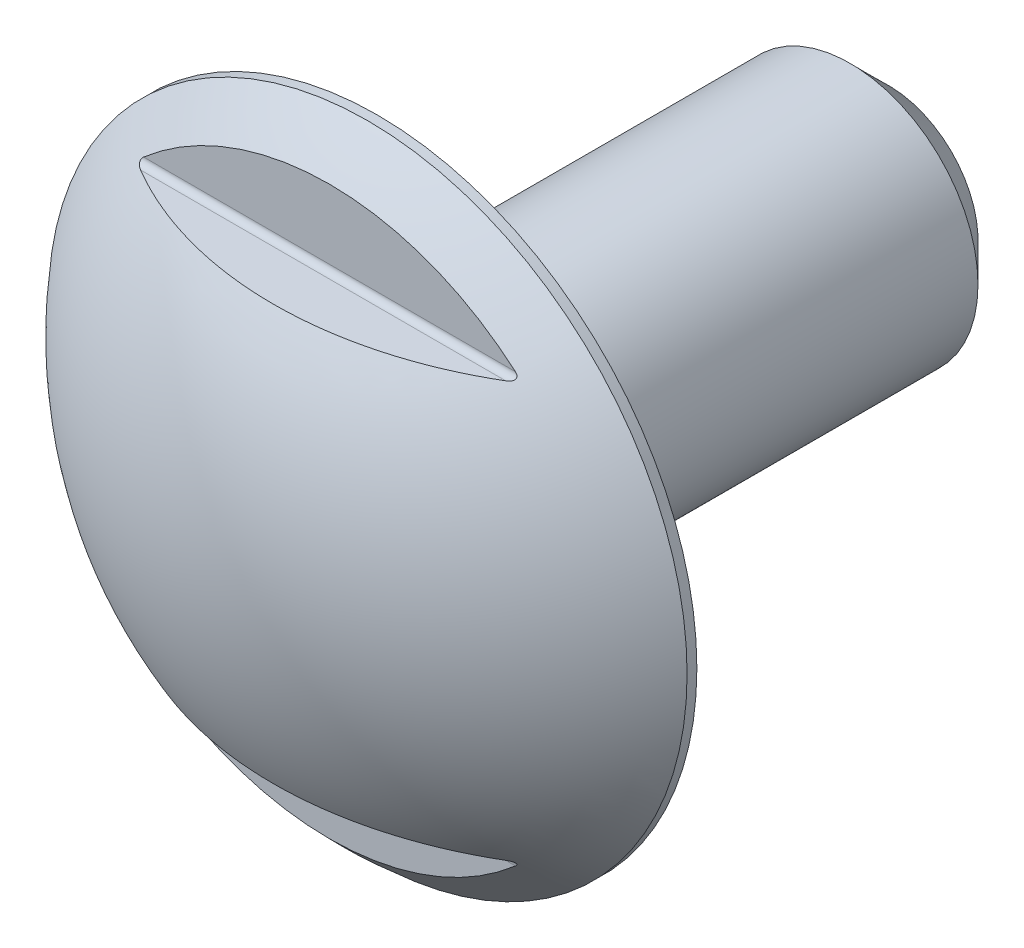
ISO-10303-21;
HEADER;
FILE_DESCRIPTION(('STEP AP214'),'2;1');
FILE_NAME('part.step','',(''),(''),'','','');
FILE_SCHEMA(('AUTOMOTIVE_DESIGN { 1 0 10303 214 1 1 1 1 }'));
ENDSEC;
DATA;
#1=APPLICATION_CONTEXT('core data for automotive mechanical design processes');
#2=APPLICATION_PROTOCOL_DEFINITION('international standard','automotive_design',2000,#1);
#3=PRODUCT_CONTEXT('',#1,'mechanical');
#4=PRODUCT('Part','Part','',(#3));
#5=PRODUCT_RELATED_PRODUCT_CATEGORY('part','',(#4));
#6=PRODUCT_DEFINITION_FORMATION('','',#4);
#7=PRODUCT_DEFINITION_CONTEXT('part definition',#1,'design');
#8=PRODUCT_DEFINITION('design','',#6,#7);
#9=PRODUCT_DEFINITION_SHAPE('','',#8);
#10=(LENGTH_UNIT() NAMED_UNIT(*) SI_UNIT(.MILLI.,.METRE.));
#11=(NAMED_UNIT(*) PLANE_ANGLE_UNIT() SI_UNIT($,.RADIAN.));
#12=(NAMED_UNIT(*) SI_UNIT($,.STERADIAN.) SOLID_ANGLE_UNIT());
#13=UNCERTAINTY_MEASURE_WITH_UNIT(LENGTH_MEASURE(1.E-05),#10,'distance_accuracy_value','');
#14=(GEOMETRIC_REPRESENTATION_CONTEXT(3) GLOBAL_UNCERTAINTY_ASSIGNED_CONTEXT((#13)) GLOBAL_UNIT_ASSIGNED_CONTEXT((#10,
#11,#12)) REPRESENTATION_CONTEXT('',''));
#15=CARTESIAN_POINT('',(0.,0.,0.));
#16=DIRECTION('',(0.,0.,1.));
#17=DIRECTION('',(1.,0.,0.));
#18=AXIS2_PLACEMENT_3D('',#15,#16,#17);
#19=CARTESIAN_POINT('',(0.,0.,-8.));
#20=DIRECTION('',(0.,0.,-1.));
#21=DIRECTION('',(0.,-1.,0.));
#22=AXIS2_PLACEMENT_3D('',#19,#20,#21);
#23=SPHERICAL_SURFACE('',#22,13.);
#24=CARTESIAN_POINT('',(5.71455323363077,-6.50000010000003,1.7002));
#25=CARTESIAN_POINT('',(5.72369421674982,-6.49999891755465,1.69481571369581));
#26=CARTESIAN_POINT('',(5.73277148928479,-6.50020699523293,1.68931126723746));
#27=CARTESIAN_POINT('',(5.75077060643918,-6.50112929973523,1.67801987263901));
#28=CARTESIAN_POINT('',(5.75969170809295,-6.50184549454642,1.67223190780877));
#29=CARTESIAN_POINT('',(5.77737661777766,-6.50388435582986,1.66030660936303));
#30=CARTESIAN_POINT('',(5.78613755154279,-6.50521371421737,1.65416609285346));
#31=CARTESIAN_POINT('',(5.80327525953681,-6.50861084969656,1.64158164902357));
#32=CARTESIAN_POINT('',(5.81165267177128,-6.51067734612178,1.63513826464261));
#33=CARTESIAN_POINT('',(5.82612016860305,-6.51519179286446,1.62333991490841));
#34=CARTESIAN_POINT('',(5.832315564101,-6.51746296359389,1.61804778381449));
#35=CARTESIAN_POINT('',(5.84422792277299,-6.52269970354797,1.60726079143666));
#36=CARTESIAN_POINT('',(5.8499449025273,-6.52566524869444,1.60176593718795));
#37=CARTESIAN_POINT('',(5.8607513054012,-6.53248829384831,1.59052992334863));
#38=CARTESIAN_POINT('',(5.86583153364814,-6.53635696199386,1.58478648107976));
#39=CARTESIAN_POINT('',(5.87489997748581,-6.54513797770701,1.57323308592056));
#40=CARTESIAN_POINT('',(5.87889217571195,-6.55004639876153,1.56742345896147));
#41=CARTESIAN_POINT('',(5.8840939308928,-6.55895625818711,1.55811489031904));
#42=CARTESIAN_POINT('',(5.8857861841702,-6.56261599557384,1.55456022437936));
#43=CARTESIAN_POINT('',(5.88840952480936,-6.57035151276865,1.54762498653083));
#44=CARTESIAN_POINT('',(5.88934135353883,-6.57442688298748,1.54424424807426));
#45=CARTESIAN_POINT('',(5.89035474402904,-6.58292472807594,1.53775927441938));
#46=CARTESIAN_POINT('',(5.89043231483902,-6.58734873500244,1.5346564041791));
#47=CARTESIAN_POINT('',(5.88971811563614,-6.59638433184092,1.52884899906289));
#48=CARTESIAN_POINT('',(5.88892602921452,-6.60099598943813,1.526144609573));
#49=CARTESIAN_POINT('',(5.88661801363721,-6.61000707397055,1.52132138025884));
#50=CARTESIAN_POINT('',(5.8851428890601,-6.61440472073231,1.51917902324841));
#51=CARTESIAN_POINT('',(5.88159909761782,-6.62313388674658,1.51529902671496));
#52=CARTESIAN_POINT('',(5.87953032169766,-6.62746539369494,1.51356146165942));
#53=CARTESIAN_POINT('',(5.87338299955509,-6.6388360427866,1.5094321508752));
#54=CARTESIAN_POINT('',(5.8688815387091,-6.64576555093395,1.50737089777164));
#55=CARTESIAN_POINT('',(5.85897930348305,-6.65918909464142,1.50408517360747));
#56=CARTESIAN_POINT('',(5.85357406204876,-6.66568073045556,1.50286502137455));
#57=CARTESIAN_POINT('',(5.84330256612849,-6.67695936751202,1.50126703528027));
#58=CARTESIAN_POINT('',(5.83854245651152,-6.6818288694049,1.50077004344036));
#59=CARTESIAN_POINT('',(5.82878697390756,-6.69123844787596,1.50013768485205));
#60=CARTESIAN_POINT('',(5.8237948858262,-6.69578163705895,1.49999827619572));
#61=CARTESIAN_POINT('',(5.81870415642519,-6.7002,1.50000010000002));
#62=B_SPLINE_CURVE_WITH_KNOTS('',3,(#24,#25,#26,#27,#28,#29,#30,#31,#32,#33,#34,#35,#36,#37,#38,
#39,#40,#41,#42,#43,#44,#45,#46,#47,#48,#49,#50,#51,#52,#53,#54,#55,#56,#57,#58,#59,#60,#61),
.UNSPECIFIED.,.F.,.F.,(4,2,2,2,2,2,2,2,2,2,2,2,2,2,2,2,2,2,4),(0.,0.0318328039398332,
0.0637895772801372,0.0961036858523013,0.128361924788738,0.153703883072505,0.179044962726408,
0.204717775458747,0.230295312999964,0.246359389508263,0.262407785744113,0.27853112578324,
0.2946603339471,0.309930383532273,0.325203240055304,0.350606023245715,0.376138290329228,
0.396599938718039,0.416829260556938),.UNSPECIFIED.);
#63=CARTESIAN_POINT('',(5.71489282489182,-6.5,1.7));
#64=VERTEX_POINT('',#63);
#65=CARTESIAN_POINT('',(5.81893461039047,-6.7,1.5));
#66=VERTEX_POINT('',#65);
#67=EDGE_CURVE('E65',#64,#66,#62,.T.);
#68=ORIENTED_EDGE('',*,*,#67,.T.);
#69=CARTESIAN_POINT('',(0.,0.,1.5));
#70=DIRECTION('',(0.,0.,1.));
#71=DIRECTION('',(-1.,0.,0.));
#72=AXIS2_PLACEMENT_3D('',#69,#70,#71);
#73=CIRCLE('',#72,8.87411967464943);
#74=CARTESIAN_POINT('',(-5.81893461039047,-6.7,1.5));
#75=VERTEX_POINT('',#74);
#76=EDGE_CURVE('E53',#66,#75,#73,.F.);
#77=ORIENTED_EDGE('',*,*,#76,.T.);
#78=CARTESIAN_POINT('',(-5.81870415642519,-6.7002,1.50000010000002));
#79=CARTESIAN_POINT('',(-5.82629700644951,-6.69359546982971,1.5000078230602));
#80=CARTESIAN_POINT('',(-5.8337158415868,-6.68669303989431,1.50031572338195));
#81=CARTESIAN_POINT('',(-5.84793411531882,-6.67213648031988,1.50180858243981));
#82=CARTESIAN_POINT('',(-5.85472041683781,-6.66447129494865,1.50300882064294));
#83=CARTESIAN_POINT('',(-5.86512205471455,-6.651028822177,1.50600903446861));
#84=CARTESIAN_POINT('',(-5.86905647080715,-6.64543415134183,1.5074933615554));
#85=CARTESIAN_POINT('',(-5.87613562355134,-6.63398909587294,1.51111281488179));
#86=CARTESIAN_POINT('',(-5.87928438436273,-6.62814020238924,1.51324449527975));
#87=CARTESIAN_POINT('',(-5.88396010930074,-6.61758139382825,1.51770242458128));
#88=CARTESIAN_POINT('',(-5.88569115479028,-6.61290212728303,1.51988416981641));
#89=CARTESIAN_POINT('',(-5.88837457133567,-6.60355515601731,1.5247117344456));
#90=CARTESIAN_POINT('',(-5.88932730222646,-6.59888744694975,1.52735733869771));
#91=CARTESIAN_POINT('',(-5.89035948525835,-6.58969138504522,1.53308251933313));
#92=CARTESIAN_POINT('',(-5.89043489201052,-6.58516377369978,1.53616403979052));
#93=CARTESIAN_POINT('',(-5.88969308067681,-6.57642454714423,1.54265085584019));
#94=CARTESIAN_POINT('',(-5.88887554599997,-6.57221304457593,1.54605626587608));
#95=CARTESIAN_POINT('',(-5.88651478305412,-6.56447623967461,1.55283316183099));
#96=CARTESIAN_POINT('',(-5.88502241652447,-6.56092408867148,1.55619234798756));
#97=CARTESIAN_POINT('',(-5.88144643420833,-6.55422204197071,1.56299049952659));
#98=CARTESIAN_POINT('',(-5.87936265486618,-6.55107225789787,1.56642948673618));
#99=CARTESIAN_POINT('',(-5.87315851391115,-6.54318228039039,1.57563821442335));
#100=CARTESIAN_POINT('',(-5.86861046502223,-6.5387953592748,1.58142154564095));
#101=CARTESIAN_POINT('',(-5.8586215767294,-6.53097427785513,1.59286202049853));
#102=CARTESIAN_POINT('',(-5.85317780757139,-6.52754334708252,1.59851867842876));
#103=CARTESIAN_POINT('',(-5.83713343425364,-6.51904567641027,1.61406010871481));
#104=CARTESIAN_POINT('',(-5.82587402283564,-6.51484720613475,1.62373070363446));
#105=CARTESIAN_POINT('',(-5.80233765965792,-6.50821128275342,1.64242201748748));
#106=CARTESIAN_POINT('',(-5.79005692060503,-6.50578074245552,1.65144006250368));
#107=CARTESIAN_POINT('',(-5.76725069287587,-6.50256854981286,1.66724254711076));
#108=CARTESIAN_POINT('',(-5.75682527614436,-6.50156384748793,1.67412977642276));
#109=CARTESIAN_POINT('',(-5.73580990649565,-6.50028426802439,1.68746318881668));
#110=CARTESIAN_POINT('',(-5.72522298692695,-6.50000155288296,1.69391336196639));
#111=CARTESIAN_POINT('',(-5.71455323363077,-6.50000010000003,1.7002));
#112=B_SPLINE_CURVE_WITH_KNOTS('',3,(#78,#79,#80,#81,#82,#83,#84,#85,#86,#87,#88,#89,#90,#91,
#92,#93,#94,#95,#96,#97,#98,#99,#100,#101,#102,#103,#104,#105,#106,#107,#108,#109,#110,#111),
.UNSPECIFIED.,.F.,.F.,(4,2,2,2,2,2,2,2,2,2,2,2,2,2,2,2,4),(0.,0.0302839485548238,
0.0610987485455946,0.0820341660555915,0.102860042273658,0.119131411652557,0.135395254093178,
0.15173406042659,0.168078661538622,0.183356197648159,0.198637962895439,0.224186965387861,
0.249821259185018,0.295836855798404,0.342031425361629,0.379606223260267,0.41677133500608),.UNSPECIFIED.);
#113=CARTESIAN_POINT('',(-5.71489282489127,-6.5,1.7));
#114=VERTEX_POINT('',#113);
#115=EDGE_CURVE('E58',#75,#114,#112,.T.);
#116=ORIENTED_EDGE('',*,*,#115,.T.);
#117=CARTESIAN_POINT('',(0.,-6.5,-8.));
#118=DIRECTION('',(0.,-1.,0.));
#119=DIRECTION('',(0.,0.,1.));
#120=AXIS2_PLACEMENT_3D('',#117,#118,#119);
#121=CIRCLE('',#120,11.2583302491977);
#122=EDGE_CURVE('E70',#114,#64,#121,.F.);
#123=ORIENTED_EDGE('',*,*,#122,.T.);
#124=EDGE_LOOP('',(#68,#77,#116,#123));
#125=FACE_BOUND('',#124,.T.);
#126=CARTESIAN_POINT('',(0.,0.,0.306623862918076));
#127=DIRECTION('',(0.,0.,-1.));
#128=DIRECTION('',(1.,0.,0.));
#129=AXIS2_PLACEMENT_3D('',#126,#127,#128);
#130=CIRCLE('',#129,10.);
#131=CARTESIAN_POINT('',(10.,0.,0.306623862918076));
#132=VERTEX_POINT('',#131);
#133=EDGE_CURVE('E59',#132,#132,#130,.T.);
#134=ORIENTED_EDGE('',*,*,#133,.F.);
#135=EDGE_LOOP('',(#134));
#136=FACE_BOUND('',#135,.T.);
#137=CARTESIAN_POINT('',(-5.71455323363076,6.50000010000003,1.7002));
#138=CARTESIAN_POINT('',(-5.72369421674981,6.49999891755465,1.69481571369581));
#139=CARTESIAN_POINT('',(-5.73277148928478,6.50020699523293,1.68931126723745));
#140=CARTESIAN_POINT('',(-5.75077060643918,6.50112929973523,1.67801987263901));
#141=CARTESIAN_POINT('',(-5.75969170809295,6.50184549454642,1.67223190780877));
#142=CARTESIAN_POINT('',(-5.77737661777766,6.50388435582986,1.66030660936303));
#143=CARTESIAN_POINT('',(-5.78613755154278,6.50521371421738,1.65416609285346));
#144=CARTESIAN_POINT('',(-5.8032752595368,6.50861084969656,1.64158164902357));
#145=CARTESIAN_POINT('',(-5.81165267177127,6.51067734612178,1.63513826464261));
#146=CARTESIAN_POINT('',(-5.82612016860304,6.51519179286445,1.62333991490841));
#147=CARTESIAN_POINT('',(-5.83231556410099,6.51746296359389,1.61804778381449));
#148=CARTESIAN_POINT('',(-5.84422792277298,6.52269970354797,1.60726079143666));
#149=CARTESIAN_POINT('',(-5.84994490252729,6.52566524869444,1.60176593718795));
#150=CARTESIAN_POINT('',(-5.86075130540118,6.53248829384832,1.59052992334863));
#151=CARTESIAN_POINT('',(-5.86583153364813,6.53635696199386,1.58478648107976));
#152=CARTESIAN_POINT('',(-5.8748999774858,6.54513797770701,1.57323308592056));
#153=CARTESIAN_POINT('',(-5.87889217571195,6.55004639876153,1.56742345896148));
#154=CARTESIAN_POINT('',(-5.8840939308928,6.55895625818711,1.55811489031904));
#155=CARTESIAN_POINT('',(-5.8857861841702,6.56261599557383,1.55456022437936));
#156=CARTESIAN_POINT('',(-5.88840952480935,6.57035151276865,1.54762498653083));
#157=CARTESIAN_POINT('',(-5.88934135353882,6.57442688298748,1.54424424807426));
#158=CARTESIAN_POINT('',(-5.89035474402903,6.58292472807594,1.53775927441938));
#159=CARTESIAN_POINT('',(-5.89043231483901,6.58734873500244,1.5346564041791));
#160=CARTESIAN_POINT('',(-5.88971811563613,6.59638433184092,1.52884899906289));
#161=CARTESIAN_POINT('',(-5.88892602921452,6.60099598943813,1.526144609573));
#162=CARTESIAN_POINT('',(-5.88661801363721,6.61000707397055,1.52132138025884));
#163=CARTESIAN_POINT('',(-5.88514288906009,6.61440472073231,1.51917902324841));
#164=CARTESIAN_POINT('',(-5.88159909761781,6.62313388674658,1.51529902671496));
#165=CARTESIAN_POINT('',(-5.87953032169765,6.62746539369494,1.51356146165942));
#166=CARTESIAN_POINT('',(-5.87338299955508,6.6388360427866,1.5094321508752));
#167=CARTESIAN_POINT('',(-5.86888153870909,6.64576555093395,1.50737089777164));
#168=CARTESIAN_POINT('',(-5.85897930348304,6.65918909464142,1.50408517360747));
#169=CARTESIAN_POINT('',(-5.85357406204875,6.66568073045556,1.50286502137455));
#170=CARTESIAN_POINT('',(-5.84330256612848,6.67695936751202,1.50126703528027));
#171=CARTESIAN_POINT('',(-5.83854245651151,6.6818288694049,1.50077004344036));
#172=CARTESIAN_POINT('',(-5.82878697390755,6.69123844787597,1.50013768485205));
#173=CARTESIAN_POINT('',(-5.82379488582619,6.69578163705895,1.49999827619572));
#174=CARTESIAN_POINT('',(-5.81870415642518,6.7002,1.50000010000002));
#175=B_SPLINE_CURVE_WITH_KNOTS('',3,(#137,#138,#139,#140,#141,#142,#143,#144,#145,#146,#147,
#148,#149,#150,#151,#152,#153,#154,#155,#156,#157,#158,#159,#160,#161,#162,#163,#164,#165,#166,
#167,#168,#169,#170,#171,#172,#173,#174),.UNSPECIFIED.,.F.,.F.,(4,2,2,2,2,2,2,2,2,2,2,2,2,2,2,2,
2,2,4),(0.,0.0318328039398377,0.0637895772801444,0.0961036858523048,0.128361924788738,
0.153703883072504,0.179044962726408,0.204717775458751,0.23029531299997,0.246359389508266,
0.262407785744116,0.278531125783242,0.294660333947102,0.309930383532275,0.325203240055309,
0.350606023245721,0.376138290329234,0.396599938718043,0.416829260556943),.UNSPECIFIED.);
#176=CARTESIAN_POINT('',(-5.71489282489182,6.5,1.7));
#177=VERTEX_POINT('',#176);
#178=CARTESIAN_POINT('',(-5.81893461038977,6.7,1.5));
#179=VERTEX_POINT('',#178);
#180=EDGE_CURVE('E116',#177,#179,#175,.T.);
#181=ORIENTED_EDGE('',*,*,#180,.T.);
#182=CARTESIAN_POINT('',(0.,0.,1.5));
#183=DIRECTION('',(0.,0.,1.));
#184=DIRECTION('',(-1.,0.,0.));
#185=AXIS2_PLACEMENT_3D('',#182,#183,#184);
#186=CIRCLE('',#185,8.87411967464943);
#187=CARTESIAN_POINT('',(5.81893461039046,6.7,1.5));
#188=VERTEX_POINT('',#187);
#189=EDGE_CURVE('E123',#179,#188,#186,.F.);
#190=ORIENTED_EDGE('',*,*,#189,.T.);
#191=CARTESIAN_POINT('',(5.81870415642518,6.7002,1.50000010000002));
#192=CARTESIAN_POINT('',(5.8262970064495,6.69359546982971,1.5000078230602));
#193=CARTESIAN_POINT('',(5.83371584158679,6.68669303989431,1.50031572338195));
#194=CARTESIAN_POINT('',(5.84793411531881,6.67213648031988,1.50180858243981));
#195=CARTESIAN_POINT('',(5.8547204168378,6.66447129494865,1.50300882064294));
#196=CARTESIAN_POINT('',(5.86512205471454,6.651028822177,1.50600903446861));
#197=CARTESIAN_POINT('',(5.86905647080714,6.64543415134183,1.5074933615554));
#198=CARTESIAN_POINT('',(5.87613562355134,6.63398909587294,1.51111281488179));
#199=CARTESIAN_POINT('',(5.87928438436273,6.62814020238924,1.51324449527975));
#200=CARTESIAN_POINT('',(5.88396010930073,6.61758139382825,1.51770242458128));
#201=CARTESIAN_POINT('',(5.88569115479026,6.61290212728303,1.51988416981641));
#202=CARTESIAN_POINT('',(5.88837457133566,6.60355515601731,1.5247117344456));
#203=CARTESIAN_POINT('',(5.88932730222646,6.59888744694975,1.52735733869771));
#204=CARTESIAN_POINT('',(5.89035948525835,6.58969138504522,1.53308251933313));
#205=CARTESIAN_POINT('',(5.89043489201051,6.58516377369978,1.53616403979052));
#206=CARTESIAN_POINT('',(5.88969308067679,6.57642454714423,1.54265085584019));
#207=CARTESIAN_POINT('',(5.88887554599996,6.57221304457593,1.54605626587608));
#208=CARTESIAN_POINT('',(5.88651478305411,6.56447623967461,1.55283316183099));
#209=CARTESIAN_POINT('',(5.88502241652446,6.56092408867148,1.55619234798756));
#210=CARTESIAN_POINT('',(5.88144643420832,6.55422204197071,1.56299049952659));
#211=CARTESIAN_POINT('',(5.87936265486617,6.55107225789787,1.56642948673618));
#212=CARTESIAN_POINT('',(5.87315851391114,6.54318228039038,1.57563821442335));
#213=CARTESIAN_POINT('',(5.86861046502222,6.5387953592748,1.58142154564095));
#214=CARTESIAN_POINT('',(5.85862157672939,6.53097427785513,1.59286202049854));
#215=CARTESIAN_POINT('',(5.85317780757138,6.52754334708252,1.59851867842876));
#216=CARTESIAN_POINT('',(5.83713343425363,6.51904567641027,1.61406010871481));
#217=CARTESIAN_POINT('',(5.82587402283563,6.51484720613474,1.62373070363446));
#218=CARTESIAN_POINT('',(5.80233765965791,6.50821128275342,1.64242201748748));
#219=CARTESIAN_POINT('',(5.79005692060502,6.50578074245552,1.65144006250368));
#220=CARTESIAN_POINT('',(5.76725069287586,6.50256854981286,1.66724254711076));
#221=CARTESIAN_POINT('',(5.75682527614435,6.50156384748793,1.67412977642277));
#222=CARTESIAN_POINT('',(5.73580990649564,6.50028426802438,1.68746318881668));
#223=CARTESIAN_POINT('',(5.72522298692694,6.50000155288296,1.69391336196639));
#224=CARTESIAN_POINT('',(5.71455323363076,6.50000010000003,1.7002));
#225=B_SPLINE_CURVE_WITH_KNOTS('',3,(#191,#192,#193,#194,#195,#196,#197,#198,#199,#200,#201,
#202,#203,#204,#205,#206,#207,#208,#209,#210,#211,#212,#213,#214,#215,#216,#217,#218,#219,#220,
#221,#222,#223,#224),.UNSPECIFIED.,.F.,.F.,(4,2,2,2,2,2,2,2,2,2,2,2,2,2,2,2,4),(0.,
0.0302839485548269,0.0610987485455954,0.082034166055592,0.102860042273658,0.119131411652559,
0.13539525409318,0.151734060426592,0.168078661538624,0.183356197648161,0.19863796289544,
0.224186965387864,0.24982125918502,0.295836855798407,0.342031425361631,0.37960622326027,
0.416771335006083),.UNSPECIFIED.);
#226=CARTESIAN_POINT('',(5.71489282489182,6.5,1.7));
#227=VERTEX_POINT('',#226);
#228=EDGE_CURVE('E110',#188,#227,#225,.T.);
#229=ORIENTED_EDGE('',*,*,#228,.T.);
#230=CARTESIAN_POINT('',(0.,6.5,-8.));
#231=DIRECTION('',(0.,1.,0.));
#232=DIRECTION('',(0.,0.,-1.));
#233=AXIS2_PLACEMENT_3D('',#230,#231,#232);
#234=CIRCLE('',#233,11.2583302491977);
#235=EDGE_CURVE('E72',#227,#177,#234,.F.);
#236=ORIENTED_EDGE('',*,*,#235,.T.);
#237=EDGE_LOOP('',(#181,#190,#229,#236));
#238=FACE_BOUND('',#237,.T.);
#239=ADVANCED_FACE('F14',(#125,#136,#238),#23,.T.);
#240=CARTESIAN_POINT('',(0.,0.,-12.));
#241=DIRECTION('',(0.,0.,-1.));
#242=DIRECTION('',(1.,0.,0.));
#243=AXIS2_PLACEMENT_3D('',#240,#241,#242);
#244=CYLINDRICAL_SURFACE('',#243,10.);
#245=CARTESIAN_POINT('',(0.,0.,0.));
#246=DIRECTION('',(0.,0.,-1.));
#247=DIRECTION('',(1.,0.,0.));
#248=AXIS2_PLACEMENT_3D('',#245,#246,#247);
#249=CIRCLE('',#248,10.);
#250=CARTESIAN_POINT('',(10.,0.,0.));
#251=VERTEX_POINT('',#250);
#252=EDGE_CURVE('E194',#251,#251,#249,.T.);
#253=ORIENTED_EDGE('',*,*,#252,.F.);
#254=EDGE_LOOP('',(#253));
#255=FACE_BOUND('',#254,.T.);
#256=ORIENTED_EDGE('',*,*,#133,.T.);
#257=EDGE_LOOP('',(#256));
#258=FACE_BOUND('',#257,.T.);
#259=ADVANCED_FACE('F137',(#255,#258),#244,.T.);
#260=CARTESIAN_POINT('',(0.,-10.,0.));
#261=DIRECTION('',(0.,0.,1.));
#262=DIRECTION('',(-1.,0.,0.));
#263=AXIS2_PLACEMENT_3D('',#260,#261,#262);
#264=PLANE('',#263);
#265=CARTESIAN_POINT('',(0.,0.,0.));
#266=DIRECTION('',(0.,0.,-1.));
#267=DIRECTION('',(1.,0.,0.));
#268=AXIS2_PLACEMENT_3D('',#265,#266,#267);
#269=CIRCLE('',#268,3.6);
#270=CARTESIAN_POINT('',(3.6,0.,0.));
#271=VERTEX_POINT('',#270);
#272=EDGE_CURVE('E191',#271,#271,#269,.T.);
#273=ORIENTED_EDGE('',*,*,#272,.F.);
#274=EDGE_LOOP('',(#273));
#275=FACE_BOUND('',#274,.T.);
#276=ORIENTED_EDGE('',*,*,#252,.T.);
#277=EDGE_LOOP('',(#276));
#278=FACE_BOUND('',#277,.T.);
#279=ADVANCED_FACE('F141',(#275,#278),#264,.F.);
#280=CARTESIAN_POINT('',(0.,0.,-0.6));
#281=DIRECTION('',(0.,0.,-1.));
#282=DIRECTION('',(1.,0.,0.));
#283=AXIS2_PLACEMENT_3D('',#280,#281,#282);
#284=TOROIDAL_SURFACE('',#283,3.6,0.6);
#285=CARTESIAN_POINT('',(0.,0.,-0.6));
#286=DIRECTION('',(0.,0.,-1.));
#287=DIRECTION('',(1.,0.,0.));
#288=AXIS2_PLACEMENT_3D('',#285,#286,#287);
#289=CIRCLE('',#288,3.);
#290=CARTESIAN_POINT('',(3.,0.,-0.6));
#291=VERTEX_POINT('',#290);
#292=EDGE_CURVE('E188',#291,#291,#289,.T.);
#293=ORIENTED_EDGE('',*,*,#292,.F.);
#294=EDGE_LOOP('',(#293));
#295=FACE_BOUND('',#294,.T.);
#296=ORIENTED_EDGE('',*,*,#272,.T.);
#297=EDGE_LOOP('',(#296));
#298=FACE_BOUND('',#297,.T.);
#299=ADVANCED_FACE('F146',(#295,#298),#284,.F.);
#300=CARTESIAN_POINT('',(0.,0.,-12.));
#301=DIRECTION('',(0.,0.,-1.));
#302=DIRECTION('',(1.,0.,0.));
#303=AXIS2_PLACEMENT_3D('',#300,#301,#302);
#304=CYLINDRICAL_SURFACE('',#303,3.);
#305=CARTESIAN_POINT('',(0.,0.,-0.807179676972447));
#306=DIRECTION('',(0.,0.,-1.));
#307=DIRECTION('',(1.,0.,0.));
#308=AXIS2_PLACEMENT_3D('',#305,#306,#307);
#309=CIRCLE('',#308,3.);
#310=CARTESIAN_POINT('',(3.,0.,-0.807179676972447));
#311=VERTEX_POINT('',#310);
#312=EDGE_CURVE('E180',#311,#311,#309,.T.);
#313=ORIENTED_EDGE('',*,*,#312,.F.);
#314=EDGE_LOOP('',(#313));
#315=FACE_BOUND('',#314,.T.);
#316=ORIENTED_EDGE('',*,*,#292,.T.);
#317=EDGE_LOOP('',(#316));
#318=FACE_BOUND('',#317,.T.);
#319=ADVANCED_FACE('F154',(#315,#318),#304,.T.);
#320=CARTESIAN_POINT('',(0.,0.,-0.80717967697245));
#321=DIRECTION('',(0.,0.,-1.));
#322=DIRECTION('',(1.,0.,0.));
#323=AXIS2_PLACEMENT_3D('',#320,#321,#322);
#324=TOROIDAL_SURFACE('',#323,3.6,0.6);
#325=CARTESIAN_POINT('',(0.,0.,-1.10717967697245));
#326=DIRECTION('',(0.,0.,-1.));
#327=DIRECTION('',(1.,0.,0.));
#328=AXIS2_PLACEMENT_3D('',#325,#326,#327);
#329=CIRCLE('',#328,3.08038475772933);
#330=CARTESIAN_POINT('',(3.08038475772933,0.,-1.10717967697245));
#331=VERTEX_POINT('',#330);
#332=EDGE_CURVE('E176',#331,#331,#329,.T.);
#333=ORIENTED_EDGE('',*,*,#332,.F.);
#334=EDGE_LOOP('',(#333));
#335=FACE_BOUND('',#334,.T.);
#336=ORIENTED_EDGE('',*,*,#312,.T.);
#337=EDGE_LOOP('',(#336));
#338=FACE_BOUND('',#337,.T.);
#339=ADVANCED_FACE('F158',(#335,#338),#324,.F.);
#340=CARTESIAN_POINT('',(0.,0.,-1.10717967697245));
#341=DIRECTION('',(0.,0.,-1.));
#342=DIRECTION('',(1.,0.,0.));
#343=AXIS2_PLACEMENT_3D('',#340,#341,#342);
#344=CONICAL_SURFACE('',#343,3.08038475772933,0.523598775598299);
#345=CARTESIAN_POINT('',(0.,0.,-2.7));
#346=DIRECTION('',(0.,0.,-1.));
#347=DIRECTION('',(1.,0.,0.));
#348=AXIS2_PLACEMENT_3D('',#345,#346,#347);
#349=CIRCLE('',#348,4.);
#350=CARTESIAN_POINT('',(4.,0.,-2.7));
#351=VERTEX_POINT('',#350);
#352=EDGE_CURVE('E175',#351,#351,#349,.T.);
#353=ORIENTED_EDGE('',*,*,#352,.F.);
#354=EDGE_LOOP('',(#353));
#355=FACE_BOUND('',#354,.T.);
#356=ORIENTED_EDGE('',*,*,#332,.T.);
#357=EDGE_LOOP('',(#356));
#358=FACE_BOUND('',#357,.T.);
#359=ADVANCED_FACE('F162',(#355,#358),#344,.T.);
#360=CARTESIAN_POINT('',(0.,0.,-12.));
#361=DIRECTION('',(0.,0.,-1.));
#362=DIRECTION('',(1.,0.,0.));
#363=AXIS2_PLACEMENT_3D('',#360,#361,#362);
#364=CYLINDRICAL_SURFACE('',#363,4.);
#365=CARTESIAN_POINT('',(0.,0.,-14.8));
#366=DIRECTION('',(0.,0.,-1.));
#367=DIRECTION('',(-1.,0.,0.));
#368=AXIS2_PLACEMENT_3D('',#365,#366,#367);
#369=CIRCLE('',#368,4.);
#370=CARTESIAN_POINT('',(-4.,0.,-14.8));
#371=VERTEX_POINT('',#370);
#372=EDGE_CURVE('E9',#371,#371,#369,.F.);
#373=ORIENTED_EDGE('',*,*,#372,.T.);
#374=EDGE_LOOP('',(#373));
#375=FACE_BOUND('',#374,.T.);
#376=ORIENTED_EDGE('',*,*,#352,.T.);
#377=EDGE_LOOP('',(#376));
#378=FACE_BOUND('',#377,.T.);
#379=ADVANCED_FACE('F165',(#375,#378),#364,.T.);
#380=CARTESIAN_POINT('',(-12.,-6.7,1.5));
#381=DIRECTION('',(0.,0.,1.));
#382=DIRECTION('',(-1.,0.,0.));
#383=AXIS2_PLACEMENT_3D('',#380,#381,#382);
#384=PLANE('',#383);
#385=DIRECTION('',(1.,0.,0.));
#386=VECTOR('',#385,1.);
#387=CARTESIAN_POINT('',(-12.,-6.7,1.5));
#388=LINE('',#387,#386);
#389=EDGE_CURVE('E35',#75,#66,#388,.T.);
#390=ORIENTED_EDGE('',*,*,#389,.F.);
#391=ORIENTED_EDGE('',*,*,#76,.F.);
#392=EDGE_LOOP('',(#390,#391));
#393=FACE_BOUND('',#392,.T.);
#394=ADVANCED_FACE('F54',(#393),#384,.T.);
#395=CARTESIAN_POINT('',(-12.,-6.7,1.7));
#396=DIRECTION('',(1.,0.,0.));
#397=DIRECTION('',(0.,1.,0.));
#398=AXIS2_PLACEMENT_3D('',#395,#396,#397);
#399=CYLINDRICAL_SURFACE('',#398,0.2);
#400=DIRECTION('',(1.,0.,0.));
#401=VECTOR('',#400,1.);
#402=CARTESIAN_POINT('',(-12.,-6.5,1.7));
#403=LINE('',#402,#401);
#404=EDGE_CURVE('E67',#114,#64,#403,.T.);
#405=ORIENTED_EDGE('',*,*,#404,.F.);
#406=ORIENTED_EDGE('',*,*,#115,.F.);
#407=ORIENTED_EDGE('',*,*,#389,.T.);
#408=ORIENTED_EDGE('',*,*,#67,.F.);
#409=EDGE_LOOP('',(#405,#406,#407,#408));
#410=FACE_BOUND('',#409,.T.);
#411=ADVANCED_FACE('F64',(#410),#399,.F.);
#412=CARTESIAN_POINT('',(-12.,-6.5,5.));
#413=DIRECTION('',(0.,-1.,0.));
#414=DIRECTION('',(0.,0.,1.));
#415=AXIS2_PLACEMENT_3D('',#412,#413,#414);
#416=PLANE('',#415);
#417=ORIENTED_EDGE('',*,*,#122,.F.);
#418=ORIENTED_EDGE('',*,*,#404,.T.);
#419=EDGE_LOOP('',(#417,#418));
#420=FACE_BOUND('',#419,.T.);
#421=ADVANCED_FACE('F91',(#420),#416,.T.);
#422=CARTESIAN_POINT('',(-12.,15.,1.5));
#423=DIRECTION('',(0.,0.,1.));
#424=DIRECTION('',(-1.,0.,0.));
#425=AXIS2_PLACEMENT_3D('',#422,#423,#424);
#426=PLANE('',#425);
#427=DIRECTION('',(1.,0.,0.));
#428=VECTOR('',#427,1.);
#429=CARTESIAN_POINT('',(-12.,6.7,1.5));
#430=LINE('',#429,#428);
#431=EDGE_CURVE('E177',#179,#188,#430,.T.);
#432=ORIENTED_EDGE('',*,*,#431,.T.);
#433=ORIENTED_EDGE('',*,*,#189,.F.);
#434=EDGE_LOOP('',(#432,#433));
#435=FACE_BOUND('',#434,.T.);
#436=ADVANCED_FACE('F96',(#435),#426,.T.);
#437=CARTESIAN_POINT('',(-12.,6.7,1.7));
#438=DIRECTION('',(1.,0.,0.));
#439=DIRECTION('',(0.,1.,0.));
#440=AXIS2_PLACEMENT_3D('',#437,#438,#439);
#441=CYLINDRICAL_SURFACE('',#440,0.2);
#442=DIRECTION('',(1.,0.,0.));
#443=VECTOR('',#442,1.);
#444=CARTESIAN_POINT('',(-12.,6.5,1.7));
#445=LINE('',#444,#443);
#446=EDGE_CURVE('E28',#177,#227,#445,.T.);
#447=ORIENTED_EDGE('',*,*,#446,.T.);
#448=ORIENTED_EDGE('',*,*,#228,.F.);
#449=ORIENTED_EDGE('',*,*,#431,.F.);
#450=ORIENTED_EDGE('',*,*,#180,.F.);
#451=EDGE_LOOP('',(#447,#448,#449,#450));
#452=FACE_BOUND('',#451,.T.);
#453=ADVANCED_FACE('F102',(#452),#441,.F.);
#454=CARTESIAN_POINT('',(-12.,6.5,1.7));
#455=DIRECTION('',(0.,1.,0.));
#456=DIRECTION('',(0.,0.,-1.));
#457=AXIS2_PLACEMENT_3D('',#454,#455,#456);
#458=PLANE('',#457);
#459=ORIENTED_EDGE('',*,*,#446,.F.);
#460=ORIENTED_EDGE('',*,*,#235,.F.);
#461=EDGE_LOOP('',(#459,#460));
#462=FACE_BOUND('',#461,.T.);
#463=ADVANCED_FACE('F98',(#462),#458,.T.);
#464=CARTESIAN_POINT('',(0.,0.,-16.));
#465=DIRECTION('',(0.,0.,-1.));
#466=DIRECTION('',(-1.,0.,0.));
#467=AXIS2_PLACEMENT_3D('',#464,#465,#466);
#468=PLANE('',#467);
#469=CARTESIAN_POINT('',(0.,0.,-16.));
#470=DIRECTION('',(0.,0.,-1.));
#471=DIRECTION('',(-1.,0.,0.));
#472=AXIS2_PLACEMENT_3D('',#469,#470,#471);
#473=CIRCLE('',#472,2.8);
#474=CARTESIAN_POINT('',(-2.8,0.,-16.));
#475=VERTEX_POINT('',#474);
#476=EDGE_CURVE('E22',#475,#475,#473,.T.);
#477=ORIENTED_EDGE('',*,*,#476,.T.);
#478=EDGE_LOOP('',(#477));
#479=FACE_BOUND('',#478,.T.);
#480=ADVANCED_FACE('F101',(#479),#468,.T.);
#481=CARTESIAN_POINT('',(0.,0.,-16.));
#482=DIRECTION('',(0.,0.,1.));
#483=DIRECTION('',(1.,0.,0.));
#484=AXIS2_PLACEMENT_3D('',#481,#482,#483);
#485=CONICAL_SURFACE('',#484,2.8,0.785398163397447);
#486=ORIENTED_EDGE('',*,*,#372,.F.);
#487=EDGE_LOOP('',(#486));
#488=FACE_BOUND('',#487,.T.);
#489=ORIENTED_EDGE('',*,*,#476,.F.);
#490=EDGE_LOOP('',(#489));
#491=FACE_BOUND('',#490,.T.);
#492=ADVANCED_FACE('F16',(#488,#491),#485,.T.);
#493=CLOSED_SHELL('',(#239,#259,#279,#299,#319,#339,#359,#379,#394,#411,#421,#436,#453,#463,
#480,#492));
#494=MANIFOLD_SOLID_BREP('B1',#493);
#495=ADVANCED_BREP_SHAPE_REPRESENTATION('',(#18,#494),#14);
#496=SHAPE_DEFINITION_REPRESENTATION(#9,#495);
ENDSEC;
END-ISO-10303-21;
